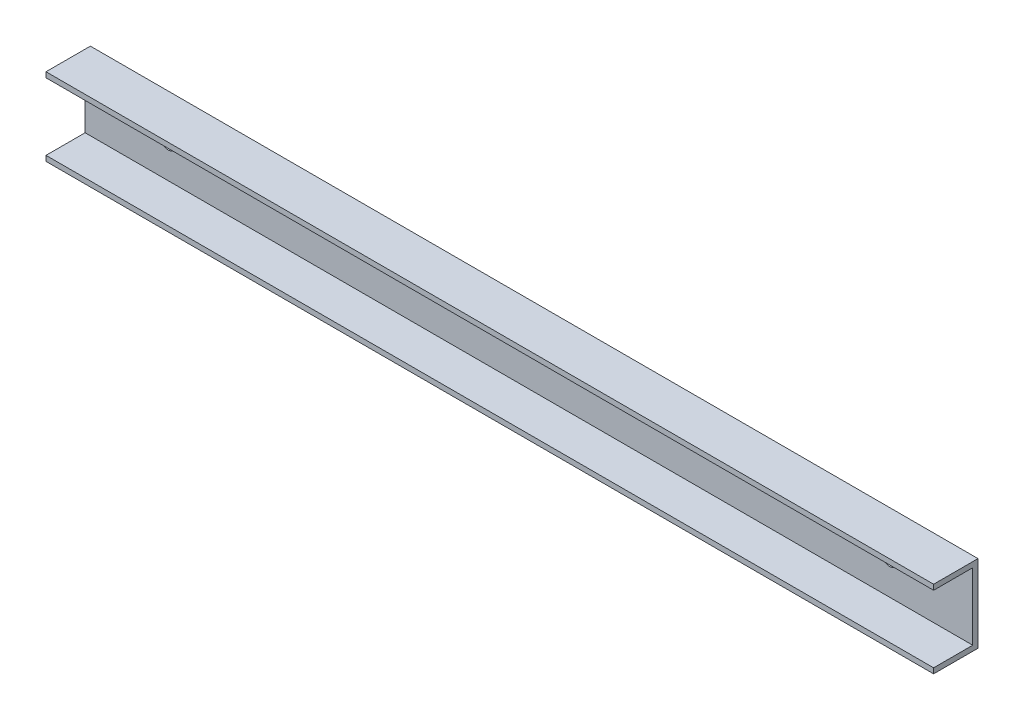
ISO-10303-21;
HEADER;
FILE_DESCRIPTION(('STEP AP214'),'2;1');
FILE_NAME('part.step','',(''),(''),'','','');
FILE_SCHEMA(('AUTOMOTIVE_DESIGN { 1 0 10303 214 1 1 1 1 }'));
ENDSEC;
DATA;
#1=APPLICATION_CONTEXT('core data for automotive mechanical design processes');
#2=APPLICATION_PROTOCOL_DEFINITION('international standard','automotive_design',2000,#1);
#3=PRODUCT_CONTEXT('',#1,'mechanical');
#4=PRODUCT('Part','Part','',(#3));
#5=PRODUCT_RELATED_PRODUCT_CATEGORY('part','',(#4));
#6=PRODUCT_DEFINITION_FORMATION('','',#4);
#7=PRODUCT_DEFINITION_CONTEXT('part definition',#1,'design');
#8=PRODUCT_DEFINITION('design','',#6,#7);
#9=PRODUCT_DEFINITION_SHAPE('','',#8);
#10=(LENGTH_UNIT() NAMED_UNIT(*) SI_UNIT(.MILLI.,.METRE.));
#11=(NAMED_UNIT(*) PLANE_ANGLE_UNIT() SI_UNIT($,.RADIAN.));
#12=(NAMED_UNIT(*) SI_UNIT($,.STERADIAN.) SOLID_ANGLE_UNIT());
#13=UNCERTAINTY_MEASURE_WITH_UNIT(LENGTH_MEASURE(1.E-05),#10,'distance_accuracy_value','');
#14=(GEOMETRIC_REPRESENTATION_CONTEXT(3) GLOBAL_UNCERTAINTY_ASSIGNED_CONTEXT((#13)) GLOBAL_UNIT_ASSIGNED_CONTEXT((#10,
#11,#12)) REPRESENTATION_CONTEXT('',''));
#15=CARTESIAN_POINT('',(0.,0.,0.));
#16=DIRECTION('',(0.,0.,1.));
#17=DIRECTION('',(1.,0.,0.));
#18=AXIS2_PLACEMENT_3D('',#15,#16,#17);
#19=CARTESIAN_POINT('',(320.,0.,1.9));
#20=DIRECTION('',(1.,0.,0.));
#21=DIRECTION('',(0.,0.,-1.));
#22=AXIS2_PLACEMENT_3D('',#19,#20,#21);
#23=PLANE('',#22);
#24=DIRECTION('',(0.,-1.,0.));
#25=VECTOR('',#24,1.);
#26=CARTESIAN_POINT('',(320.,0.,0.));
#27=LINE('',#26,#25);
#28=CARTESIAN_POINT('',(320.,1.9,0.));
#29=VERTEX_POINT('',#28);
#30=CARTESIAN_POINT('',(320.,-26.1,0.));
#31=VERTEX_POINT('',#30);
#32=EDGE_CURVE('E148',#29,#31,#27,.T.);
#33=ORIENTED_EDGE('',*,*,#32,.F.);
#34=DIRECTION('',(0.,0.,-1.));
#35=VECTOR('',#34,1.);
#36=CARTESIAN_POINT('',(320.,1.9,16.));
#37=LINE('',#36,#35);
#38=CARTESIAN_POINT('',(320.,1.9,16.));
#39=VERTEX_POINT('',#38);
#40=EDGE_CURVE('E103',#39,#29,#37,.T.);
#41=ORIENTED_EDGE('',*,*,#40,.F.);
#42=DIRECTION('',(0.,1.,0.));
#43=VECTOR('',#42,1.);
#44=CARTESIAN_POINT('',(320.,0.,16.));
#45=LINE('',#44,#43);
#46=CARTESIAN_POINT('',(320.,0.,16.));
#47=VERTEX_POINT('',#46);
#48=EDGE_CURVE('E97',#47,#39,#45,.T.);
#49=ORIENTED_EDGE('',*,*,#48,.F.);
#50=DIRECTION('',(0.,0.,-1.));
#51=VECTOR('',#50,1.);
#52=CARTESIAN_POINT('',(320.,0.,16.));
#53=LINE('',#52,#51);
#54=CARTESIAN_POINT('',(320.,0.,1.9));
#55=VERTEX_POINT('',#54);
#56=EDGE_CURVE('E101',#47,#55,#53,.T.);
#57=ORIENTED_EDGE('',*,*,#56,.T.);
#58=DIRECTION('',(0.,-1.,0.));
#59=VECTOR('',#58,1.);
#60=CARTESIAN_POINT('',(320.,0.,1.9));
#61=LINE('',#60,#59);
#62=CARTESIAN_POINT('',(320.,-24.2,1.9));
#63=VERTEX_POINT('',#62);
#64=EDGE_CURVE('E149',#55,#63,#61,.T.);
#65=ORIENTED_EDGE('',*,*,#64,.T.);
#66=DIRECTION('',(0.,0.,-1.));
#67=VECTOR('',#66,1.);
#68=CARTESIAN_POINT('',(320.,-24.2,16.));
#69=LINE('',#68,#67);
#70=CARTESIAN_POINT('',(320.,-24.2,16.));
#71=VERTEX_POINT('',#70);
#72=EDGE_CURVE('E48',#71,#63,#69,.T.);
#73=ORIENTED_EDGE('',*,*,#72,.F.);
#74=DIRECTION('',(0.,-1.,0.));
#75=VECTOR('',#74,1.);
#76=CARTESIAN_POINT('',(320.,0.,16.));
#77=LINE('',#76,#75);
#78=CARTESIAN_POINT('',(320.,-26.1,16.));
#79=VERTEX_POINT('',#78);
#80=EDGE_CURVE('E125',#71,#79,#77,.T.);
#81=ORIENTED_EDGE('',*,*,#80,.T.);
#82=DIRECTION('',(0.,0.,-1.));
#83=VECTOR('',#82,1.);
#84=CARTESIAN_POINT('',(320.,-26.1,16.));
#85=LINE('',#84,#83);
#86=EDGE_CURVE('E138',#79,#31,#85,.T.);
#87=ORIENTED_EDGE('',*,*,#86,.T.);
#88=EDGE_LOOP('',(#33,#41,#49,#57,#65,#73,#81,#87));
#89=FACE_BOUND('',#88,.T.);
#90=ADVANCED_FACE('F32',(#89),#23,.T.);
#91=CARTESIAN_POINT('',(0.,0.,1.9));
#92=DIRECTION('',(1.,0.,0.));
#93=DIRECTION('',(0.,0.,-1.));
#94=AXIS2_PLACEMENT_3D('',#91,#92,#93);
#95=PLANE('',#94);
#96=DIRECTION('',(0.,-1.,0.));
#97=VECTOR('',#96,1.);
#98=CARTESIAN_POINT('',(0.,0.,0.));
#99=LINE('',#98,#97);
#100=CARTESIAN_POINT('',(0.,1.9,0.));
#101=VERTEX_POINT('',#100);
#102=CARTESIAN_POINT('',(0.,-26.1,0.));
#103=VERTEX_POINT('',#102);
#104=EDGE_CURVE('E35',#101,#103,#99,.T.);
#105=ORIENTED_EDGE('',*,*,#104,.T.);
#106=DIRECTION('',(0.,0.,-1.));
#107=VECTOR('',#106,1.);
#108=CARTESIAN_POINT('',(0.,-26.1,16.));
#109=LINE('',#108,#107);
#110=CARTESIAN_POINT('',(0.,-26.1,16.));
#111=VERTEX_POINT('',#110);
#112=EDGE_CURVE('E142',#111,#103,#109,.T.);
#113=ORIENTED_EDGE('',*,*,#112,.F.);
#114=DIRECTION('',(0.,-1.,0.));
#115=VECTOR('',#114,1.);
#116=CARTESIAN_POINT('',(0.,0.,16.));
#117=LINE('',#116,#115);
#118=CARTESIAN_POINT('',(0.,-24.2,16.));
#119=VERTEX_POINT('',#118);
#120=EDGE_CURVE('E135',#119,#111,#117,.T.);
#121=ORIENTED_EDGE('',*,*,#120,.F.);
#122=DIRECTION('',(0.,0.,-1.));
#123=VECTOR('',#122,1.);
#124=CARTESIAN_POINT('',(0.,-24.2,16.));
#125=LINE('',#124,#123);
#126=CARTESIAN_POINT('',(0.,-24.2,1.9));
#127=VERTEX_POINT('',#126);
#128=EDGE_CURVE('E145',#119,#127,#125,.T.);
#129=ORIENTED_EDGE('',*,*,#128,.T.);
#130=DIRECTION('',(0.,-1.,0.));
#131=VECTOR('',#130,1.);
#132=CARTESIAN_POINT('',(0.,0.,1.9));
#133=LINE('',#132,#131);
#134=CARTESIAN_POINT('',(0.,0.,1.9));
#135=VERTEX_POINT('',#134);
#136=EDGE_CURVE('E40',#135,#127,#133,.T.);
#137=ORIENTED_EDGE('',*,*,#136,.F.);
#138=DIRECTION('',(0.,0.,-1.));
#139=VECTOR('',#138,1.);
#140=CARTESIAN_POINT('',(0.,0.,16.));
#141=LINE('',#140,#139);
#142=CARTESIAN_POINT('',(0.,0.,16.));
#143=VERTEX_POINT('',#142);
#144=EDGE_CURVE('E281',#143,#135,#141,.T.);
#145=ORIENTED_EDGE('',*,*,#144,.F.);
#146=DIRECTION('',(0.,1.,0.));
#147=VECTOR('',#146,1.);
#148=CARTESIAN_POINT('',(0.,0.,16.));
#149=LINE('',#148,#147);
#150=CARTESIAN_POINT('',(0.,1.9,16.));
#151=VERTEX_POINT('',#150);
#152=EDGE_CURVE('E114',#143,#151,#149,.T.);
#153=ORIENTED_EDGE('',*,*,#152,.T.);
#154=DIRECTION('',(0.,0.,-1.));
#155=VECTOR('',#154,1.);
#156=CARTESIAN_POINT('',(0.,1.9,16.));
#157=LINE('',#156,#155);
#158=EDGE_CURVE('E127',#151,#101,#157,.T.);
#159=ORIENTED_EDGE('',*,*,#158,.T.);
#160=EDGE_LOOP('',(#105,#113,#121,#129,#137,#145,#153,#159));
#161=FACE_BOUND('',#160,.T.);
#162=ADVANCED_FACE('F157',(#161),#95,.F.);
#163=CARTESIAN_POINT('',(0.,0.,1.9));
#164=DIRECTION('',(0.,0.,1.));
#165=DIRECTION('',(1.,0.,0.));
#166=AXIS2_PLACEMENT_3D('',#163,#164,#165);
#167=PLANE('',#166);
#168=CARTESIAN_POINT('',(30.,-12.1,1.9));
#169=DIRECTION('',(0.,0.,1.));
#170=DIRECTION('',(1.,0.,0.));
#171=AXIS2_PLACEMENT_3D('',#168,#169,#170);
#172=CIRCLE('',#171,2.5);
#173=CARTESIAN_POINT('',(32.5,-12.1,1.9));
#174=VERTEX_POINT('',#173);
#175=EDGE_CURVE('E294',#174,#174,#172,.T.);
#176=ORIENTED_EDGE('',*,*,#175,.F.);
#177=EDGE_LOOP('',(#176));
#178=FACE_BOUND('',#177,.T.);
#179=CARTESIAN_POINT('',(290.,-12.1,1.9));
#180=DIRECTION('',(0.,0.,1.));
#181=DIRECTION('',(1.,0.,0.));
#182=AXIS2_PLACEMENT_3D('',#179,#180,#181);
#183=CIRCLE('',#182,2.50000000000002);
#184=CARTESIAN_POINT('',(292.5,-12.1,1.9));
#185=VERTEX_POINT('',#184);
#186=EDGE_CURVE('E291',#185,#185,#183,.T.);
#187=ORIENTED_EDGE('',*,*,#186,.F.);
#188=EDGE_LOOP('',(#187));
#189=FACE_BOUND('',#188,.T.);
#190=ORIENTED_EDGE('',*,*,#64,.F.);
#191=DIRECTION('',(1.,0.,0.));
#192=VECTOR('',#191,1.);
#193=CARTESIAN_POINT('',(0.,0.,1.9));
#194=LINE('',#193,#192);
#195=EDGE_CURVE('E121',#135,#55,#194,.T.);
#196=ORIENTED_EDGE('',*,*,#195,.F.);
#197=ORIENTED_EDGE('',*,*,#136,.T.);
#198=DIRECTION('',(1.,0.,0.));
#199=VECTOR('',#198,1.);
#200=CARTESIAN_POINT('',(0.,-24.2,1.9));
#201=LINE('',#200,#199);
#202=EDGE_CURVE('E11',#127,#63,#201,.T.);
#203=ORIENTED_EDGE('',*,*,#202,.T.);
#204=EDGE_LOOP('',(#190,#196,#197,#203));
#205=FACE_BOUND('',#204,.T.);
#206=ADVANCED_FACE('F167',(#178,#189,#205),#167,.T.);
#207=CARTESIAN_POINT('',(0.,0.,0.));
#208=DIRECTION('',(0.,0.,1.));
#209=DIRECTION('',(1.,0.,0.));
#210=AXIS2_PLACEMENT_3D('',#207,#208,#209);
#211=PLANE('',#210);
#212=CARTESIAN_POINT('',(30.,-12.1,0.));
#213=DIRECTION('',(0.,0.,1.));
#214=DIRECTION('',(1.,0.,0.));
#215=AXIS2_PLACEMENT_3D('',#212,#213,#214);
#216=CIRCLE('',#215,2.5);
#217=CARTESIAN_POINT('',(32.5,-12.1,0.));
#218=VERTEX_POINT('',#217);
#219=EDGE_CURVE('E285',#218,#218,#216,.T.);
#220=ORIENTED_EDGE('',*,*,#219,.T.);
#221=EDGE_LOOP('',(#220));
#222=FACE_BOUND('',#221,.T.);
#223=CARTESIAN_POINT('',(290.,-12.1,0.));
#224=DIRECTION('',(0.,0.,1.));
#225=DIRECTION('',(1.,0.,0.));
#226=AXIS2_PLACEMENT_3D('',#223,#224,#225);
#227=CIRCLE('',#226,2.50000000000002);
#228=CARTESIAN_POINT('',(292.5,-12.1,0.));
#229=VERTEX_POINT('',#228);
#230=EDGE_CURVE('E288',#229,#229,#227,.T.);
#231=ORIENTED_EDGE('',*,*,#230,.T.);
#232=EDGE_LOOP('',(#231));
#233=FACE_BOUND('',#232,.T.);
#234=ORIENTED_EDGE('',*,*,#32,.T.);
#235=DIRECTION('',(1.,0.,0.));
#236=VECTOR('',#235,1.);
#237=CARTESIAN_POINT('',(0.,-26.1,0.));
#238=LINE('',#237,#236);
#239=EDGE_CURVE('E122',#103,#31,#238,.T.);
#240=ORIENTED_EDGE('',*,*,#239,.F.);
#241=ORIENTED_EDGE('',*,*,#104,.F.);
#242=DIRECTION('',(1.,0.,0.));
#243=VECTOR('',#242,1.);
#244=CARTESIAN_POINT('',(0.,1.9,0.));
#245=LINE('',#244,#243);
#246=EDGE_CURVE('E117',#101,#29,#245,.T.);
#247=ORIENTED_EDGE('',*,*,#246,.T.);
#248=EDGE_LOOP('',(#234,#240,#241,#247));
#249=FACE_BOUND('',#248,.T.);
#250=ADVANCED_FACE('F164',(#222,#233,#249),#211,.F.);
#251=CARTESIAN_POINT('',(0.,-24.2,16.));
#252=DIRECTION('',(0.,1.,0.));
#253=DIRECTION('',(0.,0.,1.));
#254=AXIS2_PLACEMENT_3D('',#251,#252,#253);
#255=PLANE('',#254);
#256=ORIENTED_EDGE('',*,*,#202,.F.);
#257=ORIENTED_EDGE('',*,*,#128,.F.);
#258=DIRECTION('',(1.,0.,0.));
#259=VECTOR('',#258,1.);
#260=CARTESIAN_POINT('',(0.,-24.2,16.));
#261=LINE('',#260,#259);
#262=EDGE_CURVE('E133',#119,#71,#261,.T.);
#263=ORIENTED_EDGE('',*,*,#262,.T.);
#264=ORIENTED_EDGE('',*,*,#72,.T.);
#265=EDGE_LOOP('',(#256,#257,#263,#264));
#266=FACE_BOUND('',#265,.T.);
#267=ADVANCED_FACE('F166',(#266),#255,.T.);
#268=CARTESIAN_POINT('',(0.,-26.1,16.));
#269=DIRECTION('',(0.,1.,0.));
#270=DIRECTION('',(0.,0.,1.));
#271=AXIS2_PLACEMENT_3D('',#268,#269,#270);
#272=PLANE('',#271);
#273=ORIENTED_EDGE('',*,*,#239,.T.);
#274=ORIENTED_EDGE('',*,*,#86,.F.);
#275=DIRECTION('',(1.,0.,0.));
#276=VECTOR('',#275,1.);
#277=CARTESIAN_POINT('',(0.,-26.1,16.));
#278=LINE('',#277,#276);
#279=EDGE_CURVE('E137',#111,#79,#278,.T.);
#280=ORIENTED_EDGE('',*,*,#279,.F.);
#281=ORIENTED_EDGE('',*,*,#112,.T.);
#282=EDGE_LOOP('',(#273,#274,#280,#281));
#283=FACE_BOUND('',#282,.T.);
#284=ADVANCED_FACE('F162',(#283),#272,.F.);
#285=CARTESIAN_POINT('',(0.,0.,16.));
#286=DIRECTION('',(0.,0.,1.));
#287=DIRECTION('',(1.,0.,0.));
#288=AXIS2_PLACEMENT_3D('',#285,#286,#287);
#289=PLANE('',#288);
#290=ORIENTED_EDGE('',*,*,#80,.F.);
#291=ORIENTED_EDGE('',*,*,#262,.F.);
#292=ORIENTED_EDGE('',*,*,#120,.T.);
#293=ORIENTED_EDGE('',*,*,#279,.T.);
#294=EDGE_LOOP('',(#290,#291,#292,#293));
#295=FACE_BOUND('',#294,.T.);
#296=ADVANCED_FACE('F237',(#295),#289,.T.);
#297=CARTESIAN_POINT('',(0.,0.,16.));
#298=DIRECTION('',(0.,1.,0.));
#299=DIRECTION('',(0.,0.,1.));
#300=AXIS2_PLACEMENT_3D('',#297,#298,#299);
#301=PLANE('',#300);
#302=ORIENTED_EDGE('',*,*,#144,.T.);
#303=ORIENTED_EDGE('',*,*,#195,.T.);
#304=ORIENTED_EDGE('',*,*,#56,.F.);
#305=DIRECTION('',(1.,0.,0.));
#306=VECTOR('',#305,1.);
#307=CARTESIAN_POINT('',(0.,0.,16.));
#308=LINE('',#307,#306);
#309=EDGE_CURVE('E108',#143,#47,#308,.T.);
#310=ORIENTED_EDGE('',*,*,#309,.F.);
#311=EDGE_LOOP('',(#302,#303,#304,#310));
#312=FACE_BOUND('',#311,.T.);
#313=ADVANCED_FACE('F120',(#312),#301,.F.);
#314=CARTESIAN_POINT('',(0.,1.9,16.));
#315=DIRECTION('',(0.,1.,0.));
#316=DIRECTION('',(0.,0.,1.));
#317=AXIS2_PLACEMENT_3D('',#314,#315,#316);
#318=PLANE('',#317);
#319=ORIENTED_EDGE('',*,*,#246,.F.);
#320=ORIENTED_EDGE('',*,*,#158,.F.);
#321=DIRECTION('',(1.,0.,0.));
#322=VECTOR('',#321,1.);
#323=CARTESIAN_POINT('',(0.,1.9,16.));
#324=LINE('',#323,#322);
#325=EDGE_CURVE('E107',#151,#39,#324,.T.);
#326=ORIENTED_EDGE('',*,*,#325,.T.);
#327=ORIENTED_EDGE('',*,*,#40,.T.);
#328=EDGE_LOOP('',(#319,#320,#326,#327));
#329=FACE_BOUND('',#328,.T.);
#330=ADVANCED_FACE('F231',(#329),#318,.T.);
#331=CARTESIAN_POINT('',(0.,0.,16.));
#332=DIRECTION('',(0.,0.,1.));
#333=DIRECTION('',(1.,0.,0.));
#334=AXIS2_PLACEMENT_3D('',#331,#332,#333);
#335=PLANE('',#334);
#336=ORIENTED_EDGE('',*,*,#309,.T.);
#337=ORIENTED_EDGE('',*,*,#48,.T.);
#338=ORIENTED_EDGE('',*,*,#325,.F.);
#339=ORIENTED_EDGE('',*,*,#152,.F.);
#340=EDGE_LOOP('',(#336,#337,#338,#339));
#341=FACE_BOUND('',#340,.T.);
#342=ADVANCED_FACE('F112',(#341),#335,.T.);
#343=CARTESIAN_POINT('',(290.,-12.1,0.));
#344=DIRECTION('',(0.,0.,1.));
#345=DIRECTION('',(1.,0.,0.));
#346=AXIS2_PLACEMENT_3D('',#343,#344,#345);
#347=CYLINDRICAL_SURFACE('',#346,2.50000000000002);
#348=CARTESIAN_POINT('',(292.5,-12.1,0.));
#349=CARTESIAN_POINT('',(292.5,-12.1,0.0197916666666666));
#350=CARTESIAN_POINT('',(292.5,-12.1,0.0395833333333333));
#351=CARTESIAN_POINT('',(292.5,-12.1,0.0791666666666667));
#352=CARTESIAN_POINT('',(292.5,-12.1,0.0989583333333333));
#353=CARTESIAN_POINT('',(292.5,-12.1,0.138541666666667));
#354=CARTESIAN_POINT('',(292.5,-12.1,0.158333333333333));
#355=CARTESIAN_POINT('',(292.5,-12.1,0.197916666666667));
#356=CARTESIAN_POINT('',(292.5,-12.1,0.217708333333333));
#357=CARTESIAN_POINT('',(292.5,-12.1,0.257291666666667));
#358=CARTESIAN_POINT('',(292.5,-12.1,0.277083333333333));
#359=CARTESIAN_POINT('',(292.5,-12.1,0.316666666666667));
#360=CARTESIAN_POINT('',(292.5,-12.1,0.336458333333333));
#361=CARTESIAN_POINT('',(292.5,-12.1,0.376041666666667));
#362=CARTESIAN_POINT('',(292.5,-12.1,0.395833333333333));
#363=CARTESIAN_POINT('',(292.5,-12.1,0.435416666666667));
#364=CARTESIAN_POINT('',(292.5,-12.1,0.455208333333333));
#365=CARTESIAN_POINT('',(292.5,-12.1,0.494791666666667));
#366=CARTESIAN_POINT('',(292.5,-12.1,0.514583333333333));
#367=CARTESIAN_POINT('',(292.5,-12.1,0.554166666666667));
#368=CARTESIAN_POINT('',(292.5,-12.1,0.573958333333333));
#369=CARTESIAN_POINT('',(292.5,-12.1,0.613541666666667));
#370=CARTESIAN_POINT('',(292.5,-12.1,0.633333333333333));
#371=CARTESIAN_POINT('',(292.5,-12.1,0.672916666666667));
#372=CARTESIAN_POINT('',(292.5,-12.1,0.692708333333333));
#373=CARTESIAN_POINT('',(292.5,-12.1,0.732291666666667));
#374=CARTESIAN_POINT('',(292.5,-12.1,0.752083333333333));
#375=CARTESIAN_POINT('',(292.5,-12.1,0.791666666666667));
#376=CARTESIAN_POINT('',(292.5,-12.1,0.811458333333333));
#377=CARTESIAN_POINT('',(292.5,-12.1,0.851041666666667));
#378=CARTESIAN_POINT('',(292.5,-12.1,0.870833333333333));
#379=CARTESIAN_POINT('',(292.5,-12.1,0.910416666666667));
#380=CARTESIAN_POINT('',(292.5,-12.1,0.930208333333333));
#381=CARTESIAN_POINT('',(292.5,-12.1,0.969791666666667));
#382=CARTESIAN_POINT('',(292.5,-12.1,0.989583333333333));
#383=CARTESIAN_POINT('',(292.5,-12.1,1.02916666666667));
#384=CARTESIAN_POINT('',(292.5,-12.1,1.04895833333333));
#385=CARTESIAN_POINT('',(292.5,-12.1,1.08854166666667));
#386=CARTESIAN_POINT('',(292.5,-12.1,1.10833333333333));
#387=CARTESIAN_POINT('',(292.5,-12.1,1.14791666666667));
#388=CARTESIAN_POINT('',(292.5,-12.1,1.16770833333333));
#389=CARTESIAN_POINT('',(292.5,-12.1,1.20729166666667));
#390=CARTESIAN_POINT('',(292.5,-12.1,1.22708333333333));
#391=CARTESIAN_POINT('',(292.5,-12.1,1.26666666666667));
#392=CARTESIAN_POINT('',(292.5,-12.1,1.28645833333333));
#393=CARTESIAN_POINT('',(292.5,-12.1,1.32604166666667));
#394=CARTESIAN_POINT('',(292.5,-12.1,1.34583333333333));
#395=CARTESIAN_POINT('',(292.5,-12.1,1.38541666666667));
#396=CARTESIAN_POINT('',(292.5,-12.1,1.40520833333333));
#397=CARTESIAN_POINT('',(292.5,-12.1,1.44479166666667));
#398=CARTESIAN_POINT('',(292.5,-12.1,1.46458333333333));
#399=CARTESIAN_POINT('',(292.5,-12.1,1.50416666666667));
#400=CARTESIAN_POINT('',(292.5,-12.1,1.52395833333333));
#401=CARTESIAN_POINT('',(292.5,-12.1,1.56354166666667));
#402=CARTESIAN_POINT('',(292.5,-12.1,1.58333333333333));
#403=CARTESIAN_POINT('',(292.5,-12.1,1.62291666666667));
#404=CARTESIAN_POINT('',(292.5,-12.1,1.64270833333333));
#405=CARTESIAN_POINT('',(292.5,-12.1,1.68229166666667));
#406=CARTESIAN_POINT('',(292.5,-12.1,1.70208333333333));
#407=CARTESIAN_POINT('',(292.5,-12.1,1.74166666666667));
#408=CARTESIAN_POINT('',(292.5,-12.1,1.76145833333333));
#409=CARTESIAN_POINT('',(292.5,-12.1,1.80104166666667));
#410=CARTESIAN_POINT('',(292.5,-12.1,1.82083333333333));
#411=CARTESIAN_POINT('',(292.5,-12.1,1.86041666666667));
#412=CARTESIAN_POINT('',(292.5,-12.1,1.88020833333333));
#413=CARTESIAN_POINT('',(292.5,-12.1,1.9));
#414=B_SPLINE_CURVE_WITH_KNOTS('',3,(#348,#349,#350,#351,#352,#353,#354,#355,#356,#357,#358,
#359,#360,#361,#362,#363,#364,#365,#366,#367,#368,#369,#370,#371,#372,#373,#374,#375,#376,#377,
#378,#379,#380,#381,#382,#383,#384,#385,#386,#387,#388,#389,#390,#391,#392,#393,#394,#395,#396,
#397,#398,#399,#400,#401,#402,#403,#404,#405,#406,#407,#408,#409,#410,#411,#412,#413),
.UNSPECIFIED.,.F.,.F.,(4,2,2,2,2,2,2,2,2,2,2,2,2,2,2,2,2,2,2,2,2,2,2,2,2,2,2,2,2,2,2,2,4),(0.,
0.059375,0.11875,0.178125,0.2375,0.296875,0.35625,0.415625,0.475,0.534375,0.59375,0.653125,
0.7125,0.771875,0.83125,0.890625,0.95,1.009375,1.06875,1.128125,1.1875,1.246875,1.30625,
1.365625,1.425,1.484375,1.54375,1.603125,1.6625,1.721875,1.78125,1.840625,1.9),.UNSPECIFIED.);
#415=EDGE_CURVE('BSEAM208',#229,#185,#414,.T.);
#416=ORIENTED_EDGE('',*,*,#230,.F.);
#417=ORIENTED_EDGE('',*,*,#186,.T.);
#418=ORIENTED_EDGE('',*,*,#415,.T.);
#419=ORIENTED_EDGE('',*,*,#415,.F.);
#420=EDGE_LOOP('',(#416,#418,#417,#419));
#421=FACE_BOUND('',#420,.T.);
#422=ADVANCED_FACE('F208',(#421),#347,.F.);
#423=CARTESIAN_POINT('',(30.,-12.1,0.));
#424=DIRECTION('',(0.,0.,1.));
#425=DIRECTION('',(1.,0.,0.));
#426=AXIS2_PLACEMENT_3D('',#423,#424,#425);
#427=CYLINDRICAL_SURFACE('',#426,2.5);
#428=CARTESIAN_POINT('',(32.5,-12.1,0.));
#429=CARTESIAN_POINT('',(32.5,-12.1,0.0197916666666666));
#430=CARTESIAN_POINT('',(32.5,-12.1,0.0395833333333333));
#431=CARTESIAN_POINT('',(32.5,-12.1,0.0791666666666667));
#432=CARTESIAN_POINT('',(32.5,-12.1,0.0989583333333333));
#433=CARTESIAN_POINT('',(32.5,-12.1,0.138541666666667));
#434=CARTESIAN_POINT('',(32.5,-12.1,0.158333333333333));
#435=CARTESIAN_POINT('',(32.5,-12.1,0.197916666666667));
#436=CARTESIAN_POINT('',(32.5,-12.1,0.217708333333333));
#437=CARTESIAN_POINT('',(32.5,-12.1,0.257291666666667));
#438=CARTESIAN_POINT('',(32.5,-12.1,0.277083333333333));
#439=CARTESIAN_POINT('',(32.5,-12.1,0.316666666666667));
#440=CARTESIAN_POINT('',(32.5,-12.1,0.336458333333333));
#441=CARTESIAN_POINT('',(32.5,-12.1,0.376041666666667));
#442=CARTESIAN_POINT('',(32.5,-12.1,0.395833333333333));
#443=CARTESIAN_POINT('',(32.5,-12.1,0.435416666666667));
#444=CARTESIAN_POINT('',(32.5,-12.1,0.455208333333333));
#445=CARTESIAN_POINT('',(32.5,-12.1,0.494791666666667));
#446=CARTESIAN_POINT('',(32.5,-12.1,0.514583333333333));
#447=CARTESIAN_POINT('',(32.5,-12.1,0.554166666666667));
#448=CARTESIAN_POINT('',(32.5,-12.1,0.573958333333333));
#449=CARTESIAN_POINT('',(32.5,-12.1,0.613541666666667));
#450=CARTESIAN_POINT('',(32.5,-12.1,0.633333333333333));
#451=CARTESIAN_POINT('',(32.5,-12.1,0.672916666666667));
#452=CARTESIAN_POINT('',(32.5,-12.1,0.692708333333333));
#453=CARTESIAN_POINT('',(32.5,-12.1,0.732291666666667));
#454=CARTESIAN_POINT('',(32.5,-12.1,0.752083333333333));
#455=CARTESIAN_POINT('',(32.5,-12.1,0.791666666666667));
#456=CARTESIAN_POINT('',(32.5,-12.1,0.811458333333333));
#457=CARTESIAN_POINT('',(32.5,-12.1,0.851041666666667));
#458=CARTESIAN_POINT('',(32.5,-12.1,0.870833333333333));
#459=CARTESIAN_POINT('',(32.5,-12.1,0.910416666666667));
#460=CARTESIAN_POINT('',(32.5,-12.1,0.930208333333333));
#461=CARTESIAN_POINT('',(32.5,-12.1,0.969791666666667));
#462=CARTESIAN_POINT('',(32.5,-12.1,0.989583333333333));
#463=CARTESIAN_POINT('',(32.5,-12.1,1.02916666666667));
#464=CARTESIAN_POINT('',(32.5,-12.1,1.04895833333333));
#465=CARTESIAN_POINT('',(32.5,-12.1,1.08854166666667));
#466=CARTESIAN_POINT('',(32.5,-12.1,1.10833333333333));
#467=CARTESIAN_POINT('',(32.5,-12.1,1.14791666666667));
#468=CARTESIAN_POINT('',(32.5,-12.1,1.16770833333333));
#469=CARTESIAN_POINT('',(32.5,-12.1,1.20729166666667));
#470=CARTESIAN_POINT('',(32.5,-12.1,1.22708333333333));
#471=CARTESIAN_POINT('',(32.5,-12.1,1.26666666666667));
#472=CARTESIAN_POINT('',(32.5,-12.1,1.28645833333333));
#473=CARTESIAN_POINT('',(32.5,-12.1,1.32604166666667));
#474=CARTESIAN_POINT('',(32.5,-12.1,1.34583333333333));
#475=CARTESIAN_POINT('',(32.5,-12.1,1.38541666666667));
#476=CARTESIAN_POINT('',(32.5,-12.1,1.40520833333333));
#477=CARTESIAN_POINT('',(32.5,-12.1,1.44479166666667));
#478=CARTESIAN_POINT('',(32.5,-12.1,1.46458333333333));
#479=CARTESIAN_POINT('',(32.5,-12.1,1.50416666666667));
#480=CARTESIAN_POINT('',(32.5,-12.1,1.52395833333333));
#481=CARTESIAN_POINT('',(32.5,-12.1,1.56354166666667));
#482=CARTESIAN_POINT('',(32.5,-12.1,1.58333333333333));
#483=CARTESIAN_POINT('',(32.5,-12.1,1.62291666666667));
#484=CARTESIAN_POINT('',(32.5,-12.1,1.64270833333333));
#485=CARTESIAN_POINT('',(32.5,-12.1,1.68229166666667));
#486=CARTESIAN_POINT('',(32.5,-12.1,1.70208333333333));
#487=CARTESIAN_POINT('',(32.5,-12.1,1.74166666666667));
#488=CARTESIAN_POINT('',(32.5,-12.1,1.76145833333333));
#489=CARTESIAN_POINT('',(32.5,-12.1,1.80104166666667));
#490=CARTESIAN_POINT('',(32.5,-12.1,1.82083333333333));
#491=CARTESIAN_POINT('',(32.5,-12.1,1.86041666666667));
#492=CARTESIAN_POINT('',(32.5,-12.1,1.88020833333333));
#493=CARTESIAN_POINT('',(32.5,-12.1,1.9));
#494=B_SPLINE_CURVE_WITH_KNOTS('',3,(#428,#429,#430,#431,#432,#433,#434,#435,#436,#437,#438,
#439,#440,#441,#442,#443,#444,#445,#446,#447,#448,#449,#450,#451,#452,#453,#454,#455,#456,#457,
#458,#459,#460,#461,#462,#463,#464,#465,#466,#467,#468,#469,#470,#471,#472,#473,#474,#475,#476,
#477,#478,#479,#480,#481,#482,#483,#484,#485,#486,#487,#488,#489,#490,#491,#492,#493),
.UNSPECIFIED.,.F.,.F.,(4,2,2,2,2,2,2,2,2,2,2,2,2,2,2,2,2,2,2,2,2,2,2,2,2,2,2,2,2,2,2,2,4),(0.,
0.059375,0.11875,0.178125,0.2375,0.296875,0.35625,0.415625,0.475,0.534375,0.59375,0.653125,
0.7125,0.771875,0.83125,0.890625,0.95,1.009375,1.06875,1.128125,1.1875,1.246875,1.30625,
1.365625,1.425,1.484375,1.54375,1.603125,1.6625,1.721875,1.78125,1.840625,1.9),.UNSPECIFIED.);
#495=EDGE_CURVE('BSEAM213',#218,#174,#494,.T.);
#496=ORIENTED_EDGE('',*,*,#219,.F.);
#497=ORIENTED_EDGE('',*,*,#175,.T.);
#498=ORIENTED_EDGE('',*,*,#495,.T.);
#499=ORIENTED_EDGE('',*,*,#495,.F.);
#500=EDGE_LOOP('',(#496,#498,#497,#499));
#501=FACE_BOUND('',#500,.T.);
#502=ADVANCED_FACE('F213',(#501),#427,.F.);
#503=CLOSED_SHELL('',(#90,#162,#206,#250,#267,#284,#296,#313,#330,#342,#422,#502));
#504=MANIFOLD_SOLID_BREP('B2',#503);
#505=ADVANCED_BREP_SHAPE_REPRESENTATION('',(#18,#504),#14);
#506=SHAPE_DEFINITION_REPRESENTATION(#9,#505);
ENDSEC;
END-ISO-10303-21;
